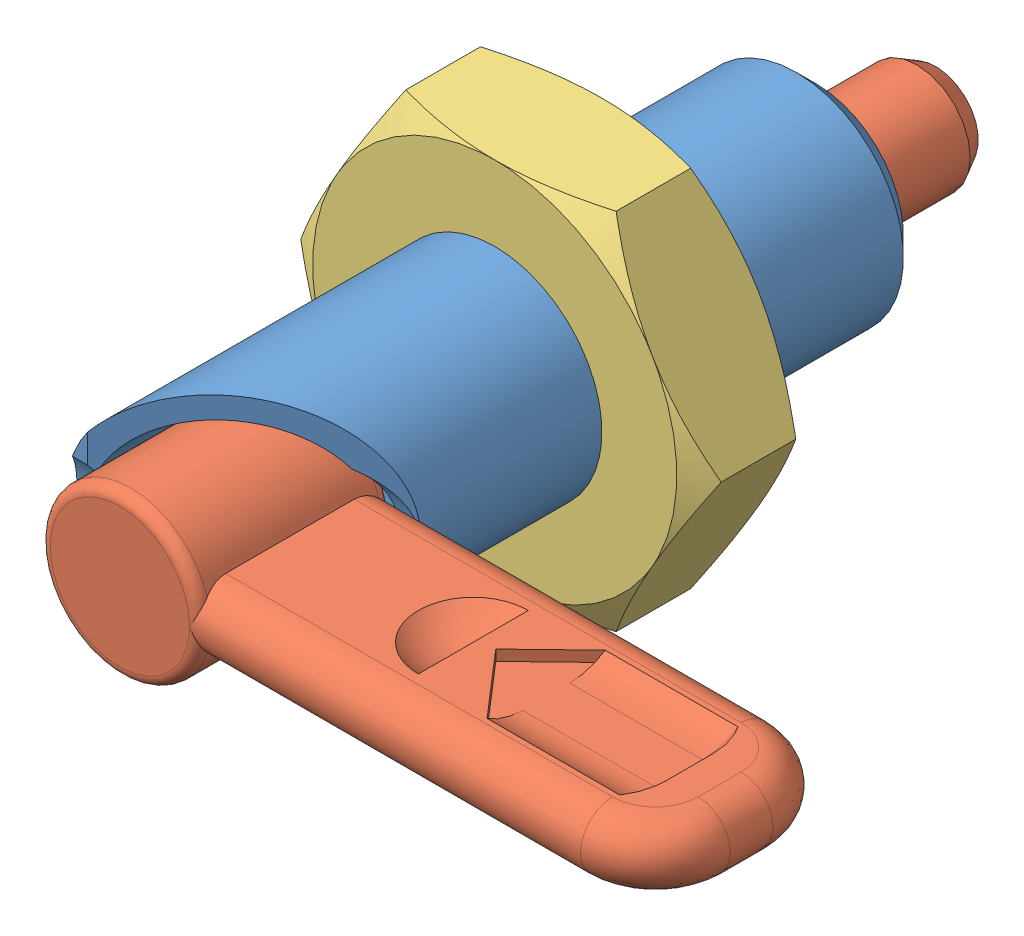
SolidWorks assembly GDX10LW-5N-SUS.sldasm, configuration Default (file format 15000). Lengths in mm.
Overall size (36.62 23.23 38.5).
3 component instances, 3 part files, 0 mates.
Components (placement in the parent):
- GDX10LW-5N-SUS_01-1: GDX10LW-5N-SUS_01.SLDPRT [ﾃﾞﾌｫﾙﾄ] x (1 0 0) z (0 -1 0) size (10.01 31.09 10.01)
- GDX10LW-5N-SUS_02-1: GDX10LW-5N-SUS_02.SLDPRT [ﾃﾞﾌｫﾙﾄ] x (1 0 0) z (0 -1 0) size (28.75 38.5 7.5)
- GDX10LW-5N-SUS_03-1: GDX10LW-5N-SUS_03.SLDPRT [ﾃﾞﾌｫﾙﾄ] at (0 0 10) x (0 0 1) z (0 1 0) size (5.01 23.23 23.23)
